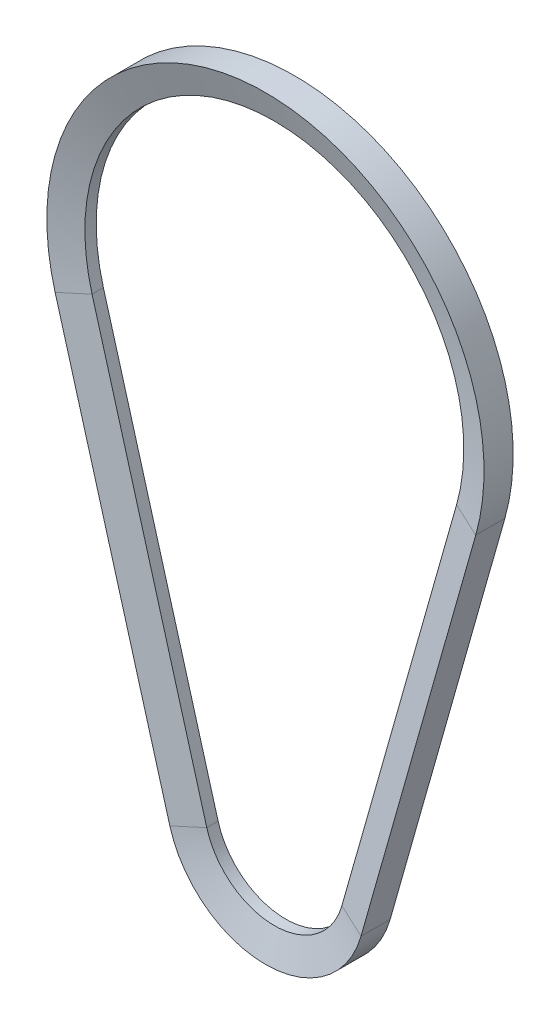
ISO-10303-21;
HEADER;
FILE_DESCRIPTION(('STEP AP214'),'2;1');
FILE_NAME('part.step','',(''),(''),'','','');
FILE_SCHEMA(('AUTOMOTIVE_DESIGN { 1 0 10303 214 1 1 1 1 }'));
ENDSEC;
DATA;
#1=APPLICATION_CONTEXT('core data for automotive mechanical design processes');
#2=APPLICATION_PROTOCOL_DEFINITION('international standard','automotive_design',2000,#1);
#3=PRODUCT_CONTEXT('',#1,'mechanical');
#4=PRODUCT('Part','Part','',(#3));
#5=PRODUCT_RELATED_PRODUCT_CATEGORY('part','',(#4));
#6=PRODUCT_DEFINITION_FORMATION('','',#4);
#7=PRODUCT_DEFINITION_CONTEXT('part definition',#1,'design');
#8=PRODUCT_DEFINITION('design','',#6,#7);
#9=PRODUCT_DEFINITION_SHAPE('','',#8);
#10=(LENGTH_UNIT() NAMED_UNIT(*) SI_UNIT(.MILLI.,.METRE.));
#11=(NAMED_UNIT(*) PLANE_ANGLE_UNIT() SI_UNIT($,.RADIAN.));
#12=(NAMED_UNIT(*) SI_UNIT($,.STERADIAN.) SOLID_ANGLE_UNIT());
#13=UNCERTAINTY_MEASURE_WITH_UNIT(LENGTH_MEASURE(1.E-05),#10,'distance_accuracy_value','');
#14=(GEOMETRIC_REPRESENTATION_CONTEXT(3) GLOBAL_UNCERTAINTY_ASSIGNED_CONTEXT((#13)) GLOBAL_UNIT_ASSIGNED_CONTEXT((#10,
#11,#12)) REPRESENTATION_CONTEXT('',''));
#15=CARTESIAN_POINT('',(0.,0.,0.));
#16=DIRECTION('',(0.,0.,1.));
#17=DIRECTION('',(1.,0.,0.));
#18=AXIS2_PLACEMENT_3D('',#15,#16,#17);
#19=CARTESIAN_POINT('',(25.4954217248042,-172.227272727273,-2.13696250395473));
#20=DIRECTION('',(0.281288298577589,-0.0797377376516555,0.956304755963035));
#21=DIRECTION('',(0.959359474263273,0.,-0.282186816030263));
#22=AXIS2_PLACEMENT_3D('',#19,#20,#21);
#23=PLANE('',#22);
#24=DIRECTION('',(0.920052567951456,-0.260810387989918,-0.292371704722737));
#25=VECTOR('',#24,1.);
#26=CARTESIAN_POINT('',(25.4954217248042,-172.227272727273,-2.13696250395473));
#27=LINE('',#26,#25);
#28=CARTESIAN_POINT('',(25.4954217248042,-172.227272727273,-2.13696250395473));
#29=VERTEX_POINT('',#28);
#30=CARTESIAN_POINT('',(36.0784269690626,-175.227272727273,-5.5));
#31=VERTEX_POINT('',#30);
#32=EDGE_CURVE('E153',#29,#31,#27,.T.);
#33=ORIENTED_EDGE('',*,*,#32,.F.);
#34=DIRECTION('',(0.272727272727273,0.962091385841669,0.));
#35=VECTOR('',#34,1.);
#36=CARTESIAN_POINT('',(25.4954217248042,-172.227272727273,-2.13696250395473));
#37=LINE('',#36,#35);
#38=CARTESIAN_POINT('',(68.7895340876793,-19.5,-2.13696250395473));
#39=VERTEX_POINT('',#38);
#40=EDGE_CURVE('E32',#29,#39,#37,.T.);
#41=ORIENTED_EDGE('',*,*,#40,.T.);
#42=DIRECTION('',(0.920052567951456,-0.260810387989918,-0.292371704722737));
#43=VECTOR('',#42,1.);
#44=CARTESIAN_POINT('',(68.7895340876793,-19.5,-2.13696250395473));
#45=LINE('',#44,#43);
#46=CARTESIAN_POINT('',(79.3725393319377,-22.5,-5.5));
#47=VERTEX_POINT('',#46);
#48=EDGE_CURVE('E174',#39,#47,#45,.T.);
#49=ORIENTED_EDGE('',*,*,#48,.T.);
#50=DIRECTION('',(0.272727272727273,0.962091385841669,0.));
#51=VECTOR('',#50,1.);
#52=CARTESIAN_POINT('',(36.0784269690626,-175.227272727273,-5.5));
#53=LINE('',#52,#51);
#54=EDGE_CURVE('E11',#31,#47,#53,.T.);
#55=ORIENTED_EDGE('',*,*,#54,.F.);
#56=EDGE_LOOP('',(#33,#41,#49,#55));
#57=FACE_BOUND('',#56,.T.);
#58=ADVANCED_FACE('F24',(#57),#23,.F.);
#59=CARTESIAN_POINT('',(25.4954217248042,-172.227272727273,2.13696250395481));
#60=DIRECTION('',(0.962091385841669,-0.272727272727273,0.));
#61=DIRECTION('',(0.272727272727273,0.962091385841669,0.));
#62=AXIS2_PLACEMENT_3D('',#59,#60,#61);
#63=PLANE('',#62);
#64=DIRECTION('',(0.,0.,-1.));
#65=VECTOR('',#64,1.);
#66=CARTESIAN_POINT('',(25.4954217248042,-172.227272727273,2.13696250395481));
#67=LINE('',#66,#65);
#68=CARTESIAN_POINT('',(25.4954217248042,-172.227272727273,2.13696250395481));
#69=VERTEX_POINT('',#68);
#70=EDGE_CURVE('E150',#69,#29,#67,.T.);
#71=ORIENTED_EDGE('',*,*,#70,.F.);
#72=DIRECTION('',(0.272727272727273,0.962091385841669,0.));
#73=VECTOR('',#72,1.);
#74=CARTESIAN_POINT('',(25.4954217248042,-172.227272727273,2.13696250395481));
#75=LINE('',#74,#73);
#76=CARTESIAN_POINT('',(68.7895340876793,-19.5,2.13696250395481));
#77=VERTEX_POINT('',#76);
#78=EDGE_CURVE('E180',#69,#77,#75,.T.);
#79=ORIENTED_EDGE('',*,*,#78,.T.);
#80=DIRECTION('',(0.,0.,-1.));
#81=VECTOR('',#80,1.);
#82=CARTESIAN_POINT('',(68.7895340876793,-19.5,2.13696250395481));
#83=LINE('',#82,#81);
#84=EDGE_CURVE('E171',#77,#39,#83,.T.);
#85=ORIENTED_EDGE('',*,*,#84,.T.);
#86=ORIENTED_EDGE('',*,*,#40,.F.);
#87=EDGE_LOOP('',(#71,#79,#85,#86));
#88=FACE_BOUND('',#87,.T.);
#89=ADVANCED_FACE('F199',(#88),#63,.F.);
#90=CARTESIAN_POINT('',(36.0784269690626,-175.227272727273,5.5));
#91=DIRECTION('',(0.281288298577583,-0.0797377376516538,-0.956304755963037));
#92=DIRECTION('',(-0.959359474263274,0.,-0.282186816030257));
#93=AXIS2_PLACEMENT_3D('',#90,#91,#92);
#94=PLANE('',#93);
#95=DIRECTION('',(-0.920052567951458,0.260810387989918,-0.292371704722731));
#96=VECTOR('',#95,1.);
#97=CARTESIAN_POINT('',(36.0784269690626,-175.227272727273,5.5));
#98=LINE('',#97,#96);
#99=CARTESIAN_POINT('',(36.0784269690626,-175.227272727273,5.5));
#100=VERTEX_POINT('',#99);
#101=EDGE_CURVE('E147',#100,#69,#98,.T.);
#102=ORIENTED_EDGE('',*,*,#101,.F.);
#103=DIRECTION('',(0.272727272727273,0.962091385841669,0.));
#104=VECTOR('',#103,1.);
#105=CARTESIAN_POINT('',(36.0784269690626,-175.227272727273,5.5));
#106=LINE('',#105,#104);
#107=CARTESIAN_POINT('',(79.3725393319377,-22.5,5.5));
#108=VERTEX_POINT('',#107);
#109=EDGE_CURVE('E177',#100,#108,#106,.T.);
#110=ORIENTED_EDGE('',*,*,#109,.T.);
#111=DIRECTION('',(-0.920052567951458,0.260810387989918,-0.292371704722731));
#112=VECTOR('',#111,1.);
#113=CARTESIAN_POINT('',(79.3725393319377,-22.5,5.5));
#114=LINE('',#113,#112);
#115=EDGE_CURVE('E119',#108,#77,#114,.T.);
#116=ORIENTED_EDGE('',*,*,#115,.T.);
#117=ORIENTED_EDGE('',*,*,#78,.F.);
#118=EDGE_LOOP('',(#102,#110,#116,#117));
#119=FACE_BOUND('',#118,.T.);
#120=ADVANCED_FACE('F197',(#119),#94,.F.);
#121=CARTESIAN_POINT('',(36.0784269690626,-175.227272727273,0.));
#122=DIRECTION('',(-0.962091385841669,0.272727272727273,0.));
#123=DIRECTION('',(-0.272727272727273,-0.962091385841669,0.));
#124=AXIS2_PLACEMENT_3D('',#121,#122,#123);
#125=PLANE('',#124);
#126=DIRECTION('',(0.,0.,1.));
#127=VECTOR('',#126,1.);
#128=CARTESIAN_POINT('',(36.0784269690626,-175.227272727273,0.));
#129=LINE('',#128,#127);
#130=EDGE_CURVE('E144',#31,#100,#129,.T.);
#131=ORIENTED_EDGE('',*,*,#130,.F.);
#132=ORIENTED_EDGE('',*,*,#54,.T.);
#133=DIRECTION('',(0.,0.,1.));
#134=VECTOR('',#133,1.);
#135=CARTESIAN_POINT('',(79.3725393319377,-22.5,0.));
#136=LINE('',#135,#134);
#137=EDGE_CURVE('E168',#47,#108,#136,.T.);
#138=ORIENTED_EDGE('',*,*,#137,.T.);
#139=ORIENTED_EDGE('',*,*,#109,.F.);
#140=EDGE_LOOP('',(#131,#132,#138,#139));
#141=FACE_BOUND('',#140,.T.);
#142=ADVANCED_FACE('F217',(#141),#125,.F.);
#143=CARTESIAN_POINT('',(0.,-165.,-2.13696250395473));
#144=DIRECTION('',(0.,0.,-1.));
#145=DIRECTION('',(-1.,0.,0.));
#146=AXIS2_PLACEMENT_3D('',#143,#144,#145);
#147=CONICAL_SURFACE('',#146,26.5,1.27409035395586);
#148=DIRECTION('',(-0.920052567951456,-0.260810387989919,-0.292371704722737));
#149=VECTOR('',#148,1.);
#150=CARTESIAN_POINT('',(-25.4954217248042,-172.227272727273,-2.13696250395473));
#151=LINE('',#150,#149);
#152=CARTESIAN_POINT('',(-25.4954217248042,-172.227272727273,-2.13696250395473));
#153=VERTEX_POINT('',#152);
#154=CARTESIAN_POINT('',(-36.0784269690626,-175.227272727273,-5.5));
#155=VERTEX_POINT('',#154);
#156=EDGE_CURVE('E104',#153,#155,#151,.T.);
#157=ORIENTED_EDGE('',*,*,#156,.F.);
#158=CARTESIAN_POINT('',(0.,-165.,-2.13696250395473));
#159=DIRECTION('',(0.,0.,1.));
#160=DIRECTION('',(1.,0.,0.));
#161=AXIS2_PLACEMENT_3D('',#158,#159,#160);
#162=CIRCLE('',#161,26.5);
#163=EDGE_CURVE('E162',#153,#29,#162,.T.);
#164=ORIENTED_EDGE('',*,*,#163,.T.);
#165=ORIENTED_EDGE('',*,*,#32,.T.);
#166=CARTESIAN_POINT('',(0.,-165.,-5.5));
#167=DIRECTION('',(0.,0.,1.));
#168=DIRECTION('',(1.,0.,0.));
#169=AXIS2_PLACEMENT_3D('',#166,#167,#168);
#170=CIRCLE('',#169,37.5);
#171=EDGE_CURVE('E165',#155,#31,#170,.T.);
#172=ORIENTED_EDGE('',*,*,#171,.F.);
#173=EDGE_LOOP('',(#157,#164,#165,#172));
#174=FACE_BOUND('',#173,.T.);
#175=ADVANCED_FACE('F222',(#174),#147,.F.);
#176=CARTESIAN_POINT('',(0.,-165.,0.));
#177=DIRECTION('',(0.,0.,1.));
#178=DIRECTION('',(1.,0.,0.));
#179=AXIS2_PLACEMENT_3D('',#176,#177,#178);
#180=CYLINDRICAL_SURFACE('',#179,26.5);
#181=DIRECTION('',(0.,0.,-1.));
#182=VECTOR('',#181,1.);
#183=CARTESIAN_POINT('',(-25.4954217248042,-172.227272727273,2.13696250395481));
#184=LINE('',#183,#182);
#185=CARTESIAN_POINT('',(-25.4954217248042,-172.227272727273,2.13696250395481));
#186=VERTEX_POINT('',#185);
#187=EDGE_CURVE('E133',#186,#153,#184,.T.);
#188=ORIENTED_EDGE('',*,*,#187,.F.);
#189=CARTESIAN_POINT('',(0.,-165.,2.13696250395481));
#190=DIRECTION('',(0.,0.,1.));
#191=DIRECTION('',(1.,0.,0.));
#192=AXIS2_PLACEMENT_3D('',#189,#190,#191);
#193=CIRCLE('',#192,26.5);
#194=EDGE_CURVE('E159',#186,#69,#193,.T.);
#195=ORIENTED_EDGE('',*,*,#194,.T.);
#196=ORIENTED_EDGE('',*,*,#70,.T.);
#197=ORIENTED_EDGE('',*,*,#163,.F.);
#198=EDGE_LOOP('',(#188,#195,#196,#197));
#199=FACE_BOUND('',#198,.T.);
#200=ADVANCED_FACE('F206',(#199),#180,.F.);
#201=CARTESIAN_POINT('',(0.,-165.,5.5));
#202=DIRECTION('',(0.,0.,1.));
#203=DIRECTION('',(1.,0.,0.));
#204=AXIS2_PLACEMENT_3D('',#201,#202,#203);
#205=CONICAL_SURFACE('',#204,37.5,1.27409035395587);
#206=DIRECTION('',(0.920052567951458,0.26081038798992,-0.292371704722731));
#207=VECTOR('',#206,1.);
#208=CARTESIAN_POINT('',(-36.0784269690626,-175.227272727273,5.5));
#209=LINE('',#208,#207);
#210=CARTESIAN_POINT('',(-36.0784269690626,-175.227272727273,5.5));
#211=VERTEX_POINT('',#210);
#212=EDGE_CURVE('E131',#211,#186,#209,.T.);
#213=ORIENTED_EDGE('',*,*,#212,.F.);
#214=CARTESIAN_POINT('',(0.,-165.,5.5));
#215=DIRECTION('',(0.,0.,1.));
#216=DIRECTION('',(1.,0.,0.));
#217=AXIS2_PLACEMENT_3D('',#214,#215,#216);
#218=CIRCLE('',#217,37.5);
#219=EDGE_CURVE('E156',#211,#100,#218,.T.);
#220=ORIENTED_EDGE('',*,*,#219,.T.);
#221=ORIENTED_EDGE('',*,*,#101,.T.);
#222=ORIENTED_EDGE('',*,*,#194,.F.);
#223=EDGE_LOOP('',(#213,#220,#221,#222));
#224=FACE_BOUND('',#223,.T.);
#225=ADVANCED_FACE('F204',(#224),#205,.F.);
#226=CARTESIAN_POINT('',(0.,-165.,0.));
#227=DIRECTION('',(0.,0.,1.));
#228=DIRECTION('',(1.,0.,0.));
#229=AXIS2_PLACEMENT_3D('',#226,#227,#228);
#230=CYLINDRICAL_SURFACE('',#229,37.5);
#231=DIRECTION('',(0.,0.,1.));
#232=VECTOR('',#231,1.);
#233=CARTESIAN_POINT('',(-36.0784269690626,-175.227272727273,0.));
#234=LINE('',#233,#232);
#235=EDGE_CURVE('E100',#155,#211,#234,.T.);
#236=ORIENTED_EDGE('',*,*,#235,.F.);
#237=ORIENTED_EDGE('',*,*,#171,.T.);
#238=ORIENTED_EDGE('',*,*,#130,.T.);
#239=ORIENTED_EDGE('',*,*,#219,.F.);
#240=EDGE_LOOP('',(#236,#237,#238,#239));
#241=FACE_BOUND('',#240,.T.);
#242=ADVANCED_FACE('F219',(#241),#230,.T.);
#243=CARTESIAN_POINT('',(-68.7895340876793,-19.5,-2.13696250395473));
#244=DIRECTION('',(-0.281288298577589,-0.0797377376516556,0.956304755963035));
#245=DIRECTION('',(0.959359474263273,0.,0.282186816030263));
#246=AXIS2_PLACEMENT_3D('',#243,#244,#245);
#247=PLANE('',#246);
#248=DIRECTION('',(-0.920052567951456,-0.260810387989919,-0.292371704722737));
#249=VECTOR('',#248,1.);
#250=CARTESIAN_POINT('',(-68.7895340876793,-19.5,-2.13696250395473));
#251=LINE('',#250,#249);
#252=CARTESIAN_POINT('',(-68.7895340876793,-19.5,-2.13696250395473));
#253=VERTEX_POINT('',#252);
#254=CARTESIAN_POINT('',(-79.3725393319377,-22.5,-5.5));
#255=VERTEX_POINT('',#254);
#256=EDGE_CURVE('E128',#253,#255,#251,.T.);
#257=ORIENTED_EDGE('',*,*,#256,.F.);
#258=DIRECTION('',(0.272727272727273,-0.962091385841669,0.));
#259=VECTOR('',#258,1.);
#260=CARTESIAN_POINT('',(-68.7895340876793,-19.5,-2.13696250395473));
#261=LINE('',#260,#259);
#262=EDGE_CURVE('E139',#253,#153,#261,.T.);
#263=ORIENTED_EDGE('',*,*,#262,.T.);
#264=ORIENTED_EDGE('',*,*,#156,.T.);
#265=DIRECTION('',(0.272727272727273,-0.962091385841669,0.));
#266=VECTOR('',#265,1.);
#267=CARTESIAN_POINT('',(-79.3725393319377,-22.5,-5.5));
#268=LINE('',#267,#266);
#269=EDGE_CURVE('E142',#255,#155,#268,.T.);
#270=ORIENTED_EDGE('',*,*,#269,.F.);
#271=EDGE_LOOP('',(#257,#263,#264,#270));
#272=FACE_BOUND('',#271,.T.);
#273=ADVANCED_FACE('F212',(#272),#247,.F.);
#274=CARTESIAN_POINT('',(-68.7895340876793,-19.5,2.13696250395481));
#275=DIRECTION('',(-0.962091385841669,-0.272727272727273,0.));
#276=DIRECTION('',(0.272727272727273,-0.962091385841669,0.));
#277=AXIS2_PLACEMENT_3D('',#274,#275,#276);
#278=PLANE('',#277);
#279=DIRECTION('',(0.,0.,-1.));
#280=VECTOR('',#279,1.);
#281=CARTESIAN_POINT('',(-68.7895340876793,-19.5,2.13696250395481));
#282=LINE('',#281,#280);
#283=CARTESIAN_POINT('',(-68.7895340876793,-19.5,2.13696250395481));
#284=VERTEX_POINT('',#283);
#285=EDGE_CURVE('E113',#284,#253,#282,.T.);
#286=ORIENTED_EDGE('',*,*,#285,.F.);
#287=DIRECTION('',(0.272727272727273,-0.962091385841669,0.));
#288=VECTOR('',#287,1.);
#289=CARTESIAN_POINT('',(-68.7895340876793,-19.5,2.13696250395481));
#290=LINE('',#289,#288);
#291=EDGE_CURVE('E103',#284,#186,#290,.T.);
#292=ORIENTED_EDGE('',*,*,#291,.T.);
#293=ORIENTED_EDGE('',*,*,#187,.T.);
#294=ORIENTED_EDGE('',*,*,#262,.F.);
#295=EDGE_LOOP('',(#286,#292,#293,#294));
#296=FACE_BOUND('',#295,.T.);
#297=ADVANCED_FACE('F209',(#296),#278,.F.);
#298=CARTESIAN_POINT('',(-79.3725393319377,-22.5,5.5));
#299=DIRECTION('',(-0.281288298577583,-0.0797377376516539,-0.956304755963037));
#300=DIRECTION('',(-0.959359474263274,0.,0.282186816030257));
#301=AXIS2_PLACEMENT_3D('',#298,#299,#300);
#302=PLANE('',#301);
#303=DIRECTION('',(0.920052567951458,0.26081038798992,-0.292371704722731));
#304=VECTOR('',#303,1.);
#305=CARTESIAN_POINT('',(-79.3725393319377,-22.5,5.5));
#306=LINE('',#305,#304);
#307=CARTESIAN_POINT('',(-79.3725393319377,-22.5,5.5));
#308=VERTEX_POINT('',#307);
#309=EDGE_CURVE('E107',#308,#284,#306,.T.);
#310=ORIENTED_EDGE('',*,*,#309,.F.);
#311=DIRECTION('',(0.272727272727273,-0.962091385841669,0.));
#312=VECTOR('',#311,1.);
#313=CARTESIAN_POINT('',(-79.3725393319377,-22.5,5.5));
#314=LINE('',#313,#312);
#315=EDGE_CURVE('E93',#308,#211,#314,.T.);
#316=ORIENTED_EDGE('',*,*,#315,.T.);
#317=ORIENTED_EDGE('',*,*,#212,.T.);
#318=ORIENTED_EDGE('',*,*,#291,.F.);
#319=EDGE_LOOP('',(#310,#316,#317,#318));
#320=FACE_BOUND('',#319,.T.);
#321=ADVANCED_FACE('F109',(#320),#302,.F.);
#322=CARTESIAN_POINT('',(-79.3725393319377,-22.5,0.));
#323=DIRECTION('',(0.962091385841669,0.272727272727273,0.));
#324=DIRECTION('',(-0.272727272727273,0.962091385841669,0.));
#325=AXIS2_PLACEMENT_3D('',#322,#323,#324);
#326=PLANE('',#325);
#327=DIRECTION('',(0.,0.,1.));
#328=VECTOR('',#327,1.);
#329=CARTESIAN_POINT('',(-79.3725393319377,-22.5,0.));
#330=LINE('',#329,#328);
#331=EDGE_CURVE('E98',#255,#308,#330,.T.);
#332=ORIENTED_EDGE('',*,*,#331,.F.);
#333=ORIENTED_EDGE('',*,*,#269,.T.);
#334=ORIENTED_EDGE('',*,*,#235,.T.);
#335=ORIENTED_EDGE('',*,*,#315,.F.);
#336=EDGE_LOOP('',(#332,#333,#334,#335));
#337=FACE_BOUND('',#336,.T.);
#338=ADVANCED_FACE('F95',(#337),#326,.F.);
#339=CARTESIAN_POINT('',(0.,0.,5.5));
#340=DIRECTION('',(0.,0.,1.));
#341=DIRECTION('',(1.,0.,0.));
#342=AXIS2_PLACEMENT_3D('',#339,#340,#341);
#343=CONICAL_SURFACE('',#342,82.5,1.27409035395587);
#344=CARTESIAN_POINT('',(0.,0.,2.13696250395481));
#345=DIRECTION('',(0.,0.,-1.));
#346=DIRECTION('',(-1.,0.,0.));
#347=AXIS2_PLACEMENT_3D('',#344,#345,#346);
#348=CIRCLE('',#347,71.5);
#349=EDGE_CURVE('E122',#284,#77,#348,.T.);
#350=ORIENTED_EDGE('',*,*,#349,.T.);
#351=ORIENTED_EDGE('',*,*,#115,.F.);
#352=CARTESIAN_POINT('',(0.,0.,5.5));
#353=DIRECTION('',(0.,0.,-1.));
#354=DIRECTION('',(-1.,0.,0.));
#355=AXIS2_PLACEMENT_3D('',#352,#353,#354);
#356=CIRCLE('',#355,82.5);
#357=EDGE_CURVE('E116',#308,#108,#356,.T.);
#358=ORIENTED_EDGE('',*,*,#357,.F.);
#359=ORIENTED_EDGE('',*,*,#309,.T.);
#360=EDGE_LOOP('',(#350,#351,#358,#359));
#361=FACE_BOUND('',#360,.T.);
#362=ADVANCED_FACE('F117',(#361),#343,.F.);
#363=CARTESIAN_POINT('',(0.,0.,0.));
#364=DIRECTION('',(0.,0.,-1.));
#365=DIRECTION('',(-1.,0.,0.));
#366=AXIS2_PLACEMENT_3D('',#363,#364,#365);
#367=CYLINDRICAL_SURFACE('',#366,71.5);
#368=CARTESIAN_POINT('',(0.,0.,-2.13696250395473));
#369=DIRECTION('',(0.,0.,-1.));
#370=DIRECTION('',(-1.,0.,0.));
#371=AXIS2_PLACEMENT_3D('',#368,#369,#370);
#372=CIRCLE('',#371,71.5);
#373=EDGE_CURVE('E48',#253,#39,#372,.T.);
#374=ORIENTED_EDGE('',*,*,#373,.T.);
#375=ORIENTED_EDGE('',*,*,#84,.F.);
#376=ORIENTED_EDGE('',*,*,#349,.F.);
#377=ORIENTED_EDGE('',*,*,#285,.T.);
#378=EDGE_LOOP('',(#374,#375,#376,#377));
#379=FACE_BOUND('',#378,.T.);
#380=ADVANCED_FACE('F193',(#379),#367,.F.);
#381=CARTESIAN_POINT('',(0.,0.,-2.13696250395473));
#382=DIRECTION('',(0.,0.,-1.));
#383=DIRECTION('',(-1.,0.,0.));
#384=AXIS2_PLACEMENT_3D('',#381,#382,#383);
#385=CONICAL_SURFACE('',#384,71.5,1.27409035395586);
#386=CARTESIAN_POINT('',(0.,0.,-5.5));
#387=DIRECTION('',(0.,0.,-1.));
#388=DIRECTION('',(-1.,0.,0.));
#389=AXIS2_PLACEMENT_3D('',#386,#387,#388);
#390=CIRCLE('',#389,82.5);
#391=EDGE_CURVE('E40',#255,#47,#390,.T.);
#392=ORIENTED_EDGE('',*,*,#391,.T.);
#393=ORIENTED_EDGE('',*,*,#48,.F.);
#394=ORIENTED_EDGE('',*,*,#373,.F.);
#395=ORIENTED_EDGE('',*,*,#256,.T.);
#396=EDGE_LOOP('',(#392,#393,#394,#395));
#397=FACE_BOUND('',#396,.T.);
#398=ADVANCED_FACE('F213',(#397),#385,.F.);
#399=CARTESIAN_POINT('',(0.,0.,0.));
#400=DIRECTION('',(0.,0.,-1.));
#401=DIRECTION('',(-1.,0.,0.));
#402=AXIS2_PLACEMENT_3D('',#399,#400,#401);
#403=CYLINDRICAL_SURFACE('',#402,82.5);
#404=ORIENTED_EDGE('',*,*,#391,.F.);
#405=ORIENTED_EDGE('',*,*,#331,.T.);
#406=ORIENTED_EDGE('',*,*,#357,.T.);
#407=ORIENTED_EDGE('',*,*,#137,.F.);
#408=EDGE_LOOP('',(#404,#405,#406,#407));
#409=FACE_BOUND('',#408,.T.);
#410=ADVANCED_FACE('F124',(#409),#403,.T.);
#411=CLOSED_SHELL('',(#58,#89,#120,#142,#175,#200,#225,#242,#273,#297,#321,#338,#362,#380,#398,#410));
#412=MANIFOLD_SOLID_BREP('B2',#411);
#413=ADVANCED_BREP_SHAPE_REPRESENTATION('',(#18,#412),#14);
#414=SHAPE_DEFINITION_REPRESENTATION(#9,#413);
ENDSEC;
END-ISO-10303-21;
